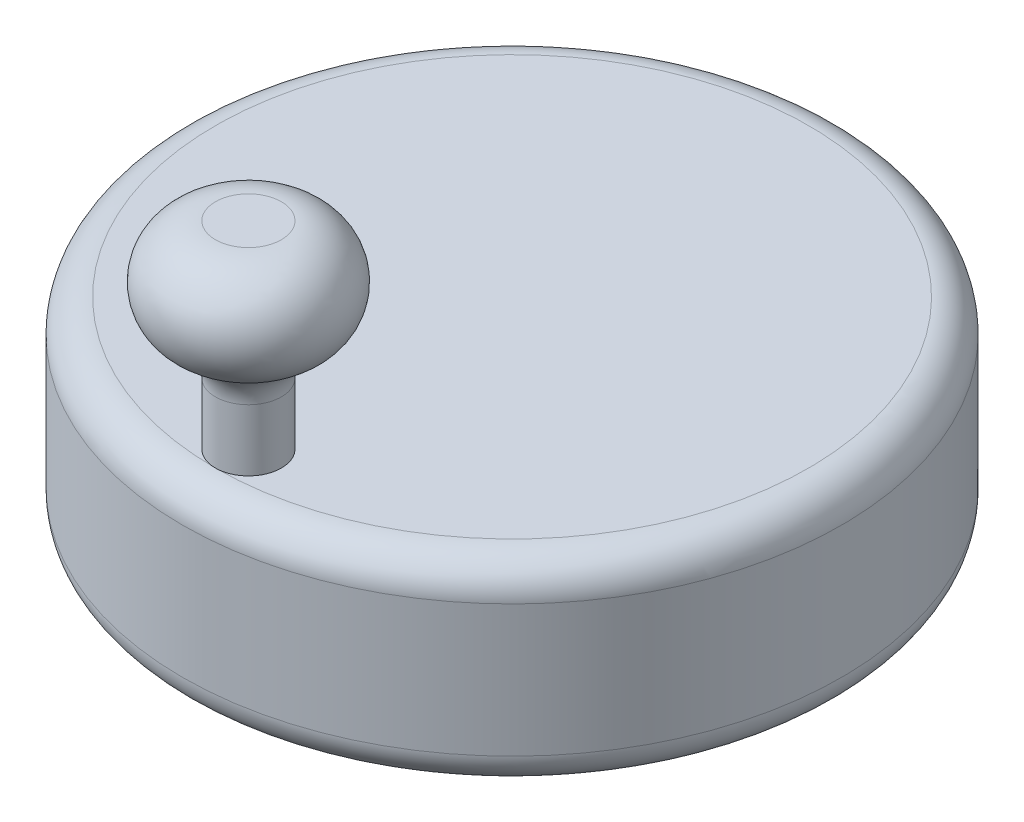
ISO-10303-21;
HEADER;
FILE_DESCRIPTION(('STEP AP214'),'2;1');
FILE_NAME('part.step','',(''),(''),'','','');
FILE_SCHEMA(('AUTOMOTIVE_DESIGN { 1 0 10303 214 1 1 1 1 }'));
ENDSEC;
DATA;
#1=APPLICATION_CONTEXT('core data for automotive mechanical design processes');
#2=APPLICATION_PROTOCOL_DEFINITION('international standard','automotive_design',2000,#1);
#3=PRODUCT_CONTEXT('',#1,'mechanical');
#4=PRODUCT('Part','Part','',(#3));
#5=PRODUCT_RELATED_PRODUCT_CATEGORY('part','',(#4));
#6=PRODUCT_DEFINITION_FORMATION('','',#4);
#7=PRODUCT_DEFINITION_CONTEXT('part definition',#1,'design');
#8=PRODUCT_DEFINITION('design','',#6,#7);
#9=PRODUCT_DEFINITION_SHAPE('','',#8);
#10=(LENGTH_UNIT() NAMED_UNIT(*) SI_UNIT(.MILLI.,.METRE.));
#11=(NAMED_UNIT(*) PLANE_ANGLE_UNIT() SI_UNIT($,.RADIAN.));
#12=(NAMED_UNIT(*) SI_UNIT($,.STERADIAN.) SOLID_ANGLE_UNIT());
#13=UNCERTAINTY_MEASURE_WITH_UNIT(LENGTH_MEASURE(1.E-05),#10,'distance_accuracy_value','');
#14=(GEOMETRIC_REPRESENTATION_CONTEXT(3) GLOBAL_UNCERTAINTY_ASSIGNED_CONTEXT((#13)) GLOBAL_UNIT_ASSIGNED_CONTEXT((#10,
#11,#12)) REPRESENTATION_CONTEXT('',''));
#15=CARTESIAN_POINT('',(0.,0.,0.));
#16=DIRECTION('',(0.,0.,1.));
#17=DIRECTION('',(1.,0.,0.));
#18=AXIS2_PLACEMENT_3D('',#15,#16,#17);
#19=CARTESIAN_POINT('',(0.,15.,0.));
#20=DIRECTION('',(0.,1.,0.));
#21=DIRECTION('',(0.,0.,1.));
#22=AXIS2_PLACEMENT_3D('',#19,#20,#21);
#23=PLANE('',#22);
#24=CARTESIAN_POINT('',(0.,15.,20.));
#25=DIRECTION('',(0.,-1.,0.));
#26=DIRECTION('',(0.,0.,-1.));
#27=AXIS2_PLACEMENT_3D('',#24,#25,#26);
#28=CIRCLE('',#27,2.5);
#29=CARTESIAN_POINT('',(0.,15.,22.5));
#30=VERTEX_POINT('',#29);
#31=EDGE_CURVE('E195',#30,#30,#28,.T.);
#32=ORIENTED_EDGE('',*,*,#31,.T.);
#33=CARTESIAN_POINT('',(0.,15.,0.));
#34=DIRECTION('',(0.,1.,0.));
#35=DIRECTION('',(0.,0.,1.));
#36=AXIS2_PLACEMENT_3D('',#33,#34,#35);
#37=CIRCLE('',#36,22.5);
#38=EDGE_CURVE('E11',#30,#30,#37,.T.);
#39=ORIENTED_EDGE('',*,*,#38,.T.);
#40=EDGE_LOOP('',(#32,#39));
#41=FACE_BOUND('',#40,.T.);
#42=ADVANCED_FACE('F33',(#41),#23,.T.);
#43=CARTESIAN_POINT('',(0.,15.,0.));
#44=DIRECTION('',(0.,-1.,0.));
#45=DIRECTION('',(0.,0.,-1.));
#46=AXIS2_PLACEMENT_3D('',#43,#44,#45);
#47=CYLINDRICAL_SURFACE('',#46,25.);
#48=CARTESIAN_POINT('',(0.,2.5,0.));
#49=DIRECTION('',(0.,1.,0.));
#50=DIRECTION('',(0.,0.,1.));
#51=AXIS2_PLACEMENT_3D('',#48,#49,#50);
#52=CIRCLE('',#51,25.);
#53=CARTESIAN_POINT('',(0.,2.5,25.));
#54=VERTEX_POINT('',#53);
#55=EDGE_CURVE('E118',#54,#54,#52,.T.);
#56=ORIENTED_EDGE('',*,*,#55,.T.);
#57=EDGE_LOOP('',(#56));
#58=FACE_BOUND('',#57,.T.);
#59=CARTESIAN_POINT('',(0.,12.5,0.));
#60=DIRECTION('',(0.,1.,0.));
#61=DIRECTION('',(0.,0.,1.));
#62=AXIS2_PLACEMENT_3D('',#59,#60,#61);
#63=CIRCLE('',#62,25.);
#64=CARTESIAN_POINT('',(0.,12.5,25.));
#65=VERTEX_POINT('',#64);
#66=EDGE_CURVE('E112',#65,#65,#63,.F.);
#67=ORIENTED_EDGE('',*,*,#66,.T.);
#68=EDGE_LOOP('',(#67));
#69=FACE_BOUND('',#68,.T.);
#70=ADVANCED_FACE('F132',(#58,#69),#47,.T.);
#71=CARTESIAN_POINT('',(0.,0.,0.));
#72=DIRECTION('',(0.,1.,0.));
#73=DIRECTION('',(0.,0.,1.));
#74=AXIS2_PLACEMENT_3D('',#71,#72,#73);
#75=PLANE('',#74);
#76=CARTESIAN_POINT('',(0.,0.,0.));
#77=DIRECTION('',(0.,1.,0.));
#78=DIRECTION('',(0.,0.,1.));
#79=AXIS2_PLACEMENT_3D('',#76,#77,#78);
#80=CIRCLE('',#79,22.5);
#81=CARTESIAN_POINT('',(0.,0.,22.5));
#82=VERTEX_POINT('',#81);
#83=EDGE_CURVE('E41',#82,#82,#80,.F.);
#84=ORIENTED_EDGE('',*,*,#83,.T.);
#85=EDGE_LOOP('',(#84));
#86=FACE_BOUND('',#85,.T.);
#87=DIRECTION('',(-1.,0.,0.));
#88=VECTOR('',#87,1.);
#89=CARTESIAN_POINT('',(-1.76776695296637,0.,1.76776695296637));
#90=LINE('',#89,#88);
#91=CARTESIAN_POINT('',(1.76776695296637,0.,1.76776695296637));
#92=VERTEX_POINT('',#91);
#93=CARTESIAN_POINT('',(-1.76776695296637,0.,1.76776695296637));
#94=VERTEX_POINT('',#93);
#95=EDGE_CURVE('E106',#92,#94,#90,.T.);
#96=ORIENTED_EDGE('',*,*,#95,.F.);
#97=DIRECTION('',(0.,0.,1.));
#98=VECTOR('',#97,1.);
#99=CARTESIAN_POINT('',(1.76776695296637,0.,-1.76776695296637));
#100=LINE('',#99,#98);
#101=CARTESIAN_POINT('',(1.76776695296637,0.,-1.76776695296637));
#102=VERTEX_POINT('',#101);
#103=EDGE_CURVE('E51',#102,#92,#100,.T.);
#104=ORIENTED_EDGE('',*,*,#103,.F.);
#105=DIRECTION('',(1.,0.,0.));
#106=VECTOR('',#105,1.);
#107=CARTESIAN_POINT('',(-1.76776695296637,0.,-1.76776695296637));
#108=LINE('',#107,#106);
#109=CARTESIAN_POINT('',(-1.76776695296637,0.,-1.76776695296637));
#110=VERTEX_POINT('',#109);
#111=EDGE_CURVE('E94',#110,#102,#108,.T.);
#112=ORIENTED_EDGE('',*,*,#111,.F.);
#113=DIRECTION('',(0.,0.,-1.));
#114=VECTOR('',#113,1.);
#115=CARTESIAN_POINT('',(-1.76776695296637,0.,-1.76776695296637));
#116=LINE('',#115,#114);
#117=EDGE_CURVE('E97',#94,#110,#116,.T.);
#118=ORIENTED_EDGE('',*,*,#117,.F.);
#119=EDGE_LOOP('',(#96,#104,#112,#118));
#120=FACE_BOUND('',#119,.T.);
#121=ADVANCED_FACE('F123',(#86,#120),#75,.F.);
#122=CARTESIAN_POINT('',(1.76776695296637,10.,-1.76776695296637));
#123=DIRECTION('',(1.,0.,0.));
#124=DIRECTION('',(0.,0.,-1.));
#125=AXIS2_PLACEMENT_3D('',#122,#123,#124);
#126=PLANE('',#125);
#127=ORIENTED_EDGE('',*,*,#103,.T.);
#128=DIRECTION('',(0.,-1.,0.));
#129=VECTOR('',#128,1.);
#130=CARTESIAN_POINT('',(1.76776695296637,10.,1.76776695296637));
#131=LINE('',#130,#129);
#132=CARTESIAN_POINT('',(1.76776695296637,10.,1.76776695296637));
#133=VERTEX_POINT('',#132);
#134=EDGE_CURVE('E72',#133,#92,#131,.T.);
#135=ORIENTED_EDGE('',*,*,#134,.F.);
#136=DIRECTION('',(0.,0.,1.));
#137=VECTOR('',#136,1.);
#138=CARTESIAN_POINT('',(1.76776695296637,10.,-1.76776695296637));
#139=LINE('',#138,#137);
#140=CARTESIAN_POINT('',(1.76776695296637,10.,-1.76776695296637));
#141=VERTEX_POINT('',#140);
#142=EDGE_CURVE('E76',#141,#133,#139,.T.);
#143=ORIENTED_EDGE('',*,*,#142,.F.);
#144=DIRECTION('',(0.,-1.,0.));
#145=VECTOR('',#144,1.);
#146=CARTESIAN_POINT('',(1.76776695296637,10.,-1.76776695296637));
#147=LINE('',#146,#145);
#148=EDGE_CURVE('E110',#141,#102,#147,.T.);
#149=ORIENTED_EDGE('',*,*,#148,.T.);
#150=EDGE_LOOP('',(#127,#135,#143,#149));
#151=FACE_BOUND('',#150,.T.);
#152=ADVANCED_FACE('F74',(#151),#126,.F.);
#153=CARTESIAN_POINT('',(-1.76776695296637,10.,-1.76776695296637));
#154=DIRECTION('',(0.,0.,-1.));
#155=DIRECTION('',(-1.,0.,0.));
#156=AXIS2_PLACEMENT_3D('',#153,#154,#155);
#157=PLANE('',#156);
#158=ORIENTED_EDGE('',*,*,#111,.T.);
#159=ORIENTED_EDGE('',*,*,#148,.F.);
#160=DIRECTION('',(1.,0.,0.));
#161=VECTOR('',#160,1.);
#162=CARTESIAN_POINT('',(-1.76776695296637,10.,-1.76776695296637));
#163=LINE('',#162,#161);
#164=CARTESIAN_POINT('',(-1.76776695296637,10.,-1.76776695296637));
#165=VERTEX_POINT('',#164);
#166=EDGE_CURVE('E82',#165,#141,#163,.T.);
#167=ORIENTED_EDGE('',*,*,#166,.F.);
#168=DIRECTION('',(0.,-1.,0.));
#169=VECTOR('',#168,1.);
#170=CARTESIAN_POINT('',(-1.76776695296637,10.,-1.76776695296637));
#171=LINE('',#170,#169);
#172=EDGE_CURVE('E113',#165,#110,#171,.T.);
#173=ORIENTED_EDGE('',*,*,#172,.T.);
#174=EDGE_LOOP('',(#158,#159,#167,#173));
#175=FACE_BOUND('',#174,.T.);
#176=ADVANCED_FACE('F154',(#175),#157,.F.);
#177=CARTESIAN_POINT('',(-1.76776695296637,10.,-1.76776695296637));
#178=DIRECTION('',(-1.,0.,0.));
#179=DIRECTION('',(0.,0.,1.));
#180=AXIS2_PLACEMENT_3D('',#177,#178,#179);
#181=PLANE('',#180);
#182=ORIENTED_EDGE('',*,*,#117,.T.);
#183=ORIENTED_EDGE('',*,*,#172,.F.);
#184=DIRECTION('',(0.,0.,-1.));
#185=VECTOR('',#184,1.);
#186=CARTESIAN_POINT('',(-1.76776695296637,10.,-1.76776695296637));
#187=LINE('',#186,#185);
#188=CARTESIAN_POINT('',(-1.76776695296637,10.,1.76776695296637));
#189=VERTEX_POINT('',#188);
#190=EDGE_CURVE('E90',#189,#165,#187,.T.);
#191=ORIENTED_EDGE('',*,*,#190,.F.);
#192=DIRECTION('',(0.,-1.,0.));
#193=VECTOR('',#192,1.);
#194=CARTESIAN_POINT('',(-1.76776695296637,10.,1.76776695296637));
#195=LINE('',#194,#193);
#196=EDGE_CURVE('E81',#189,#94,#195,.T.);
#197=ORIENTED_EDGE('',*,*,#196,.T.);
#198=EDGE_LOOP('',(#182,#183,#191,#197));
#199=FACE_BOUND('',#198,.T.);
#200=ADVANCED_FACE('F158',(#199),#181,.F.);
#201=CARTESIAN_POINT('',(-1.76776695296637,10.,1.76776695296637));
#202=DIRECTION('',(0.,0.,1.));
#203=DIRECTION('',(1.,0.,0.));
#204=AXIS2_PLACEMENT_3D('',#201,#202,#203);
#205=PLANE('',#204);
#206=ORIENTED_EDGE('',*,*,#95,.T.);
#207=ORIENTED_EDGE('',*,*,#196,.F.);
#208=DIRECTION('',(-1.,0.,0.));
#209=VECTOR('',#208,1.);
#210=CARTESIAN_POINT('',(-1.76776695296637,10.,1.76776695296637));
#211=LINE('',#210,#209);
#212=EDGE_CURVE('E85',#133,#189,#211,.T.);
#213=ORIENTED_EDGE('',*,*,#212,.F.);
#214=ORIENTED_EDGE('',*,*,#134,.T.);
#215=EDGE_LOOP('',(#206,#207,#213,#214));
#216=FACE_BOUND('',#215,.T.);
#217=ADVANCED_FACE('F86',(#216),#205,.F.);
#218=CARTESIAN_POINT('',(0.,10.,0.));
#219=DIRECTION('',(0.,1.,0.));
#220=DIRECTION('',(0.,0.,1.));
#221=AXIS2_PLACEMENT_3D('',#218,#219,#220);
#222=PLANE('',#221);
#223=ORIENTED_EDGE('',*,*,#142,.T.);
#224=ORIENTED_EDGE('',*,*,#212,.T.);
#225=ORIENTED_EDGE('',*,*,#190,.T.);
#226=ORIENTED_EDGE('',*,*,#166,.T.);
#227=EDGE_LOOP('',(#223,#224,#225,#226));
#228=FACE_BOUND('',#227,.T.);
#229=ADVANCED_FACE('F92',(#228),#222,.F.);
#230=CARTESIAN_POINT('',(0.,30.,20.));
#231=DIRECTION('',(0.,-1.,0.));
#232=DIRECTION('',(0.,0.,-1.));
#233=AXIS2_PLACEMENT_3D('',#230,#231,#232);
#234=PLANE('',#233);
#235=CARTESIAN_POINT('',(0.,30.,20.));
#236=DIRECTION('',(0.,-1.,0.));
#237=DIRECTION('',(0.,0.,-1.));
#238=AXIS2_PLACEMENT_3D('',#235,#236,#237);
#239=CIRCLE('',#238,2.5);
#240=CARTESIAN_POINT('',(0.,30.,17.5));
#241=VERTEX_POINT('',#240);
#242=EDGE_CURVE('E100',#241,#241,#239,.T.);
#243=ORIENTED_EDGE('',*,*,#242,.F.);
#244=EDGE_LOOP('',(#243));
#245=FACE_BOUND('',#244,.T.);
#246=ADVANCED_FACE('F172',(#245),#234,.F.);
#247=CARTESIAN_POINT('',(0.,26.,20.));
#248=DIRECTION('',(0.,-1.,0.));
#249=DIRECTION('',(0.,0.,-1.));
#250=AXIS2_PLACEMENT_3D('',#247,#248,#249);
#251=DEGENERATE_TOROIDAL_SURFACE('',#250,2.5,4.,.T.);
#252=CARTESIAN_POINT('',(0.,22.385968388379,20.));
#253=DIRECTION('',(0.,-1.,0.));
#254=DIRECTION('',(0.,0.,-1.));
#255=AXIS2_PLACEMENT_3D('',#252,#253,#254);
#256=CIRCLE('',#255,4.21428571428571);
#257=CARTESIAN_POINT('',(0.,22.385968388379,15.7857142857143));
#258=VERTEX_POINT('',#257);
#259=EDGE_CURVE('E199',#258,#258,#256,.T.);
#260=ORIENTED_EDGE('',*,*,#259,.F.);
#261=EDGE_LOOP('',(#260));
#262=FACE_BOUND('',#261,.T.);
#263=ORIENTED_EDGE('',*,*,#242,.T.);
#264=EDGE_LOOP('',(#263));
#265=FACE_BOUND('',#264,.T.);
#266=ADVANCED_FACE('F176',(#262,#265),#251,.T.);
#267=CARTESIAN_POINT('',(0.,19.6754446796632,20.));
#268=DIRECTION('',(0.,-1.,0.));
#269=DIRECTION('',(0.,0.,-1.));
#270=AXIS2_PLACEMENT_3D('',#267,#268,#269);
#271=TOROIDAL_SURFACE('',#270,5.5,3.);
#272=CARTESIAN_POINT('',(0.,19.6754446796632,20.));
#273=DIRECTION('',(0.,-1.,0.));
#274=DIRECTION('',(0.,0.,-1.));
#275=AXIS2_PLACEMENT_3D('',#272,#273,#274);
#276=CIRCLE('',#275,2.5);
#277=CARTESIAN_POINT('',(0.,19.6754446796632,17.5));
#278=VERTEX_POINT('',#277);
#279=EDGE_CURVE('E198',#278,#278,#276,.T.);
#280=ORIENTED_EDGE('',*,*,#279,.F.);
#281=EDGE_LOOP('',(#280));
#282=FACE_BOUND('',#281,.T.);
#283=ORIENTED_EDGE('',*,*,#259,.T.);
#284=EDGE_LOOP('',(#283));
#285=FACE_BOUND('',#284,.T.);
#286=ADVANCED_FACE('F181',(#282,#285),#271,.F.);
#287=CARTESIAN_POINT('',(0.,15.,20.));
#288=DIRECTION('',(0.,-1.,0.));
#289=DIRECTION('',(0.,0.,-1.));
#290=AXIS2_PLACEMENT_3D('',#287,#288,#289);
#291=CYLINDRICAL_SURFACE('',#290,2.5);
#292=ORIENTED_EDGE('',*,*,#31,.F.);
#293=EDGE_LOOP('',(#292));
#294=FACE_BOUND('',#293,.T.);
#295=ORIENTED_EDGE('',*,*,#279,.T.);
#296=EDGE_LOOP('',(#295));
#297=FACE_BOUND('',#296,.T.);
#298=ADVANCED_FACE('F129',(#294,#297),#291,.T.);
#299=CARTESIAN_POINT('',(0.,2.5,0.));
#300=DIRECTION('',(0.,1.,0.));
#301=DIRECTION('',(0.,0.,1.));
#302=AXIS2_PLACEMENT_3D('',#299,#300,#301);
#303=TOROIDAL_SURFACE('',#302,22.5,2.5);
#304=ORIENTED_EDGE('',*,*,#83,.F.);
#305=EDGE_LOOP('',(#304));
#306=FACE_BOUND('',#305,.T.);
#307=ORIENTED_EDGE('',*,*,#55,.F.);
#308=EDGE_LOOP('',(#307));
#309=FACE_BOUND('',#308,.T.);
#310=ADVANCED_FACE('F126',(#306,#309),#303,.T.);
#311=CARTESIAN_POINT('',(0.,12.5,0.));
#312=DIRECTION('',(0.,1.,0.));
#313=DIRECTION('',(0.,0.,1.));
#314=AXIS2_PLACEMENT_3D('',#311,#312,#313);
#315=TOROIDAL_SURFACE('',#314,22.5,2.5);
#316=ORIENTED_EDGE('',*,*,#66,.F.);
#317=EDGE_LOOP('',(#316));
#318=FACE_BOUND('',#317,.T.);
#319=ORIENTED_EDGE('',*,*,#38,.F.);
#320=EDGE_LOOP('',(#319));
#321=FACE_BOUND('',#320,.T.);
#322=ADVANCED_FACE('F35',(#318,#321),#315,.T.);
#323=CLOSED_SHELL('',(#42,#70,#121,#152,#176,#200,#217,#229,#246,#266,#286,#298,#310,#322));
#324=MANIFOLD_SOLID_BREP('B2',#323);
#325=ADVANCED_BREP_SHAPE_REPRESENTATION('',(#18,#324),#14);
#326=SHAPE_DEFINITION_REPRESENTATION(#9,#325);
ENDSEC;
END-ISO-10303-21;
